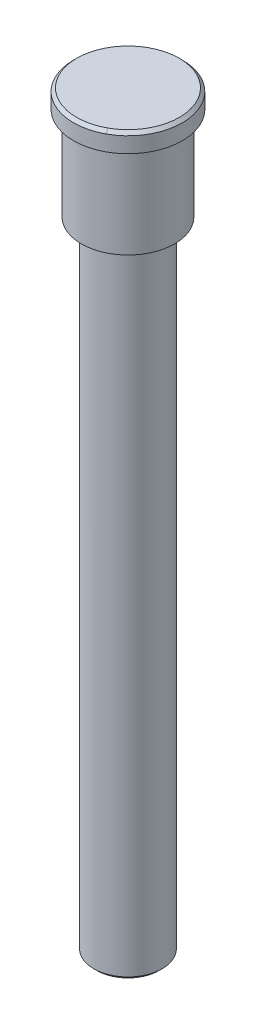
ISO-10303-21;
HEADER;
FILE_DESCRIPTION(('STEP AP214'),'2;1');
FILE_NAME('part.step','',(''),(''),'','','');
FILE_SCHEMA(('AUTOMOTIVE_DESIGN { 1 0 10303 214 1 1 1 1 }'));
ENDSEC;
DATA;
#1=APPLICATION_CONTEXT('core data for automotive mechanical design processes');
#2=APPLICATION_PROTOCOL_DEFINITION('international standard','automotive_design',2000,#1);
#3=PRODUCT_CONTEXT('',#1,'mechanical');
#4=PRODUCT('Part','Part','',(#3));
#5=PRODUCT_RELATED_PRODUCT_CATEGORY('part','',(#4));
#6=PRODUCT_DEFINITION_FORMATION('','',#4);
#7=PRODUCT_DEFINITION_CONTEXT('part definition',#1,'design');
#8=PRODUCT_DEFINITION('design','',#6,#7);
#9=PRODUCT_DEFINITION_SHAPE('','',#8);
#10=(LENGTH_UNIT() NAMED_UNIT(*) SI_UNIT(.MILLI.,.METRE.));
#11=(NAMED_UNIT(*) PLANE_ANGLE_UNIT() SI_UNIT($,.RADIAN.));
#12=(NAMED_UNIT(*) SI_UNIT($,.STERADIAN.) SOLID_ANGLE_UNIT());
#13=UNCERTAINTY_MEASURE_WITH_UNIT(LENGTH_MEASURE(1.E-05),#10,'distance_accuracy_value','');
#14=(GEOMETRIC_REPRESENTATION_CONTEXT(3) GLOBAL_UNCERTAINTY_ASSIGNED_CONTEXT((#13)) GLOBAL_UNIT_ASSIGNED_CONTEXT((#10,
#11,#12)) REPRESENTATION_CONTEXT('',''));
#15=CARTESIAN_POINT('',(0.,0.,0.));
#16=DIRECTION('',(0.,0.,1.));
#17=DIRECTION('',(1.,0.,0.));
#18=AXIS2_PLACEMENT_3D('',#15,#16,#17);
#19=CARTESIAN_POINT('',(0.,0.,0.));
#20=DIRECTION('',(0.,1.,0.));
#21=DIRECTION('',(0.,0.,1.));
#22=AXIS2_PLACEMENT_3D('',#19,#20,#21);
#23=PLANE('',#22);
#24=CARTESIAN_POINT('',(0.,-5.68017854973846E-11,0.));
#25=DIRECTION('',(0.,-1.,0.));
#26=DIRECTION('',(0.,0.,-1.));
#27=AXIS2_PLACEMENT_3D('',#24,#25,#26);
#28=CIRCLE('',#27,16.5000000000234);
#29=CARTESIAN_POINT('',(7.91052138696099,-2.84355872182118E-11,14.4801122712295));
#30=VERTEX_POINT('',#29);
#31=CARTESIAN_POINT('',(-7.91052085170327,-2.83939538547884E-11,-14.4801125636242));
#32=VERTEX_POINT('',#31);
#33=EDGE_CURVE('E20',#30,#32,#28,.T.);
#34=ORIENTED_EDGE('',*,*,#33,.F.);
#35=CARTESIAN_POINT('',(0.,0.,0.));
#36=DIRECTION('',(0.,-1.,0.));
#37=DIRECTION('',(0.,0.,-1.));
#38=AXIS2_PLACEMENT_3D('',#35,#36,#37);
#39=CIRCLE('',#38,16.5000000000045);
#40=EDGE_CURVE('E64',#32,#30,#39,.T.);
#41=ORIENTED_EDGE('',*,*,#40,.F.);
#42=EDGE_LOOP('',(#34,#41));
#43=FACE_BOUND('',#42,.T.);
#44=ADVANCED_FACE('F16',(#43),#23,.T.);
#45=CARTESIAN_POINT('',(0.,-0.999999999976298,0.));
#46=DIRECTION('',(0.,-1.,0.));
#47=DIRECTION('',(0.,0.,-1.));
#48=AXIS2_PLACEMENT_3D('',#45,#46,#47);
#49=CONICAL_SURFACE('',#48,17.4999999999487,0.785398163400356);
#50=DIRECTION('',(-0.339005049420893,0.707106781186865,-0.620544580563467));
#51=VECTOR('',#50,1.);
#52=CARTESIAN_POINT('',(239241.254284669,-499000.,437928.178495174));
#53=LINE('',#52,#51);
#54=CARTESIAN_POINT('',(8.38994692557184,-1.00000000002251,15.3576948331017));
#55=VERTEX_POINT('',#54);
#56=EDGE_CURVE('E62',#30,#55,#53,.F.);
#57=ORIENTED_EDGE('',*,*,#56,.F.);
#58=ORIENTED_EDGE('',*,*,#33,.T.);
#59=CARTESIAN_POINT('',(-8.38994692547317,-1.00000000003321,-15.3576948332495));
#60=CARTESIAN_POINT('',(-8.36997083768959,-0.958333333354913,-15.3211289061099));
#61=CARTESIAN_POINT('',(-8.34999475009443,-0.916666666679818,-15.2845629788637));
#62=CARTESIAN_POINT('',(-8.31004257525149,-0.833333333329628,-15.2114311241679));
#63=CARTESIAN_POINT('',(-8.29006648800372,-0.791666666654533,-15.1748651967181));
#64=CARTESIAN_POINT('',(-8.25011431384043,-0.708333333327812,-15.101733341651));
#65=CARTESIAN_POINT('',(-8.23013822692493,-0.666666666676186,-15.0651674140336));
#66=CARTESIAN_POINT('',(-8.19018605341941,-0.583333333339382,-14.9920355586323));
#67=CARTESIAN_POINT('',(-8.1702099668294,-0.541666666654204,-14.9554696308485));
#68=CARTESIAN_POINT('',(-8.13025779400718,-0.458333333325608,-14.8823377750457));
#69=CARTESIAN_POINT('',(-8.11028170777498,-0.41666666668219,-14.8457718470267));
#70=CARTESIAN_POINT('',(-8.07032953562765,-0.333333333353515,-14.7726399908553));
#71=CARTESIAN_POINT('',(-8.05035344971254,-0.291666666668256,-14.7360740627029));
#72=CARTESIAN_POINT('',(-8.01040127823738,-0.208333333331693,-14.6629422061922));
#73=CARTESIAN_POINT('',(-7.99042519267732,-0.166666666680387,-14.6263762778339));
#74=CARTESIAN_POINT('',(-7.95047302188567,-0.0833333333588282,-14.5532444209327));
#75=CARTESIAN_POINT('',(-7.93049693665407,-0.0416666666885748,-14.5166784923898));
#76=CARTESIAN_POINT('',(-7.91052085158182,0.,-14.4801125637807));
#77=B_SPLINE_CURVE_WITH_KNOTS('',3,(#59,#60,#61,#62,#63,#64,#65,#66,#67,#68,#69,#70,#71,#72,#73,
#74,#75,#76),.UNSPECIFIED.,.F.,.F.,(4,2,2,2,2,2,2,2,4),(0.,0.17677669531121,0.353553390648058,
0.53033008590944,0.70710678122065,0.883883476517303,1.06066017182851,1.23743686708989,
1.4142135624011),.UNSPECIFIED.);
#78=CARTESIAN_POINT('',(-8.38994692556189,-1.00000000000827,-15.3576948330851));
#79=VERTEX_POINT('',#78);
#80=EDGE_CURVE('E59',#79,#32,#77,.T.);
#81=ORIENTED_EDGE('',*,*,#80,.F.);
#82=CARTESIAN_POINT('',(0.,-1.00000000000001,0.));
#83=DIRECTION('',(0.,1.,0.));
#84=DIRECTION('',(0.,0.,1.));
#85=AXIS2_PLACEMENT_3D('',#82,#83,#84);
#86=CIRCLE('',#85,17.5);
#87=EDGE_CURVE('E66',#55,#79,#86,.F.);
#88=ORIENTED_EDGE('',*,*,#87,.F.);
#89=EDGE_LOOP('',(#57,#58,#81,#88));
#90=FACE_BOUND('',#89,.T.);
#91=ADVANCED_FACE('F57',(#90),#49,.T.);
#92=CARTESIAN_POINT('',(0.,-1.00000000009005,0.));
#93=DIRECTION('',(0.,-1.,0.));
#94=DIRECTION('',(0.,0.,-1.));
#95=AXIS2_PLACEMENT_3D('',#92,#93,#94);
#96=CONICAL_SURFACE('',#95,17.5000000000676,0.785398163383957);
#97=ORIENTED_EDGE('',*,*,#80,.T.);
#98=ORIENTED_EDGE('',*,*,#40,.T.);
#99=ORIENTED_EDGE('',*,*,#56,.T.);
#100=CARTESIAN_POINT('',(0.,-1.00000000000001,0.));
#101=DIRECTION('',(0.,1.,0.));
#102=DIRECTION('',(0.,0.,1.));
#103=AXIS2_PLACEMENT_3D('',#100,#101,#102);
#104=CIRCLE('',#103,17.5);
#105=EDGE_CURVE('E70',#79,#55,#104,.F.);
#106=ORIENTED_EDGE('',*,*,#105,.F.);
#107=EDGE_LOOP('',(#97,#98,#99,#106));
#108=FACE_BOUND('',#107,.T.);
#109=ADVANCED_FACE('F68',(#108),#96,.T.);
#110=CARTESIAN_POINT('',(0.,-120.5,0.));
#111=DIRECTION('',(0.,1.,0.));
#112=DIRECTION('',(0.,0.,1.));
#113=AXIS2_PLACEMENT_3D('',#110,#111,#112);
#114=CYLINDRICAL_SURFACE('',#113,17.5);
#115=CARTESIAN_POINT('',(0.,-6.00000000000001,0.));
#116=DIRECTION('',(0.,1.,0.));
#117=DIRECTION('',(0.,0.,1.));
#118=AXIS2_PLACEMENT_3D('',#115,#116,#117);
#119=CIRCLE('',#118,17.5);
#120=CARTESIAN_POINT('',(0.,-6.,17.5));
#121=VERTEX_POINT('',#120);
#122=EDGE_CURVE('E119',#121,#121,#119,.T.);
#123=ORIENTED_EDGE('',*,*,#122,.T.);
#124=EDGE_LOOP('',(#123));
#125=FACE_BOUND('',#124,.T.);
#126=ORIENTED_EDGE('',*,*,#105,.T.);
#127=ORIENTED_EDGE('',*,*,#87,.T.);
#128=EDGE_LOOP('',(#126,#127));
#129=FACE_BOUND('',#128,.T.);
#130=ADVANCED_FACE('F159',(#125,#129),#114,.T.);
#131=CARTESIAN_POINT('',(0.,-5.99999999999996,17.5));
#132=DIRECTION('',(0.,1.,0.));
#133=DIRECTION('',(0.,0.,1.));
#134=AXIS2_PLACEMENT_3D('',#131,#132,#133);
#135=PLANE('',#134);
#136=CARTESIAN_POINT('',(0.,-6.00000000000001,0.));
#137=DIRECTION('',(0.,1.,0.));
#138=DIRECTION('',(0.,0.,1.));
#139=AXIS2_PLACEMENT_3D('',#136,#137,#138);
#140=CIRCLE('',#139,15.);
#141=CARTESIAN_POINT('',(0.,-6.,15.));
#142=VERTEX_POINT('',#141);
#143=EDGE_CURVE('E122',#142,#142,#140,.F.);
#144=ORIENTED_EDGE('',*,*,#143,.F.);
#145=EDGE_LOOP('',(#144));
#146=FACE_BOUND('',#145,.T.);
#147=ORIENTED_EDGE('',*,*,#122,.F.);
#148=EDGE_LOOP('',(#147));
#149=FACE_BOUND('',#148,.T.);
#150=ADVANCED_FACE('F154',(#146,#149),#135,.F.);
#151=CARTESIAN_POINT('',(0.,-120.5,0.));
#152=DIRECTION('',(0.,1.,0.));
#153=DIRECTION('',(0.,0.,1.));
#154=AXIS2_PLACEMENT_3D('',#151,#152,#153);
#155=CYLINDRICAL_SURFACE('',#154,15.);
#156=CARTESIAN_POINT('',(0.,-36.,0.));
#157=DIRECTION('',(0.,1.,0.));
#158=DIRECTION('',(0.,0.,1.));
#159=AXIS2_PLACEMENT_3D('',#156,#157,#158);
#160=CIRCLE('',#159,15.);
#161=CARTESIAN_POINT('',(0.,-36.,15.));
#162=VERTEX_POINT('',#161);
#163=EDGE_CURVE('E132',#162,#162,#160,.T.);
#164=ORIENTED_EDGE('',*,*,#163,.T.);
#165=EDGE_LOOP('',(#164));
#166=FACE_BOUND('',#165,.T.);
#167=ORIENTED_EDGE('',*,*,#143,.T.);
#168=EDGE_LOOP('',(#167));
#169=FACE_BOUND('',#168,.T.);
#170=ADVANCED_FACE('F102',(#166,#169),#155,.T.);
#171=CARTESIAN_POINT('',(0.,-240.000000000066,0.));
#172=DIRECTION('',(0.,1.,0.));
#173=DIRECTION('',(-1.,0.,0.));
#174=AXIS2_PLACEMENT_3D('',#171,#172,#173);
#175=CONICAL_SURFACE('',#174,10.9999999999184,0.785398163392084);
#176=CARTESIAN_POINT('',(-4.79425457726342,-241.000000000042,-8.77582606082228));
#177=CARTESIAN_POINT('',(-4.81423067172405,-240.958333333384,-8.81239198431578));
#178=CARTESIAN_POINT('',(-4.83420676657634,-240.91666666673,-8.84895790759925));
#179=CARTESIAN_POINT('',(-4.87415895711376,-240.833333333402,-8.92208975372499));
#180=CARTESIAN_POINT('',(-4.8941350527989,-240.791666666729,-8.95865567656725));
#181=CARTESIAN_POINT('',(-4.9340872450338,-240.708333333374,-9.03178752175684));
#182=CARTESIAN_POINT('',(-4.95406334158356,-240.666666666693,-9.06835344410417));
#183=CARTESIAN_POINT('',(-4.99401553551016,-240.583333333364,-9.141485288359));
#184=CARTESIAN_POINT('',(-5.01399163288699,-240.541666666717,-9.17805121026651));
#185=CARTESIAN_POINT('',(-5.05394382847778,-240.458333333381,-9.25118305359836));
#186=CARTESIAN_POINT('',(-5.07391992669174,-240.416666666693,-9.2877489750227));
#187=CARTESIAN_POINT('',(-5.11387212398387,-240.333333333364,-9.36088081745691));
#188=CARTESIAN_POINT('',(-5.13384822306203,-240.291666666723,-9.39744673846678));
#189=CARTESIAN_POINT('',(-5.17380042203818,-240.208333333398,-9.47057857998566));
#190=CARTESIAN_POINT('',(-5.19377652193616,-240.166666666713,-9.50714450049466));
#191=CARTESIAN_POINT('',(-5.23372872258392,-240.083333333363,-9.58027634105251));
#192=CARTESIAN_POINT('',(-5.2537048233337,-240.041666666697,-9.61684226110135));
#193=CARTESIAN_POINT('',(-5.27368092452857,-240.000000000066,-9.65340818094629));
#194=B_SPLINE_CURVE_WITH_KNOTS('',3,(#176,#177,#178,#179,#180,#181,#182,#183,#184,#185,#186,
#187,#188,#189,#190,#191,#192,#193),.UNSPECIFIED.,.F.,.F.,(4,2,2,2,2,2,2,2,4),(0.,
0.176776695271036,0.353553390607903,0.530330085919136,0.707106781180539,0.883883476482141,
1.06066017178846,1.23743686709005,1.4142135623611),.UNSPECIFIED.);
#195=CARTESIAN_POINT('',(-4.79425457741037,-240.999999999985,-8.77582606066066));
#196=VERTEX_POINT('',#195);
#197=CARTESIAN_POINT('',(-5.27368092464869,-240.000000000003,-9.65340818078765));
#198=VERTEX_POINT('',#197);
#199=EDGE_CURVE('E35',#196,#198,#194,.T.);
#200=ORIENTED_EDGE('',*,*,#199,.T.);
#201=CARTESIAN_POINT('',(0.,-240.,0.));
#202=DIRECTION('',(0.,1.,0.));
#203=DIRECTION('',(0.,0.,1.));
#204=AXIS2_PLACEMENT_3D('',#201,#202,#203);
#205=CIRCLE('',#204,11.);
#206=CARTESIAN_POINT('',(5.27368092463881,-240.000000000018,9.65340818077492));
#207=VERTEX_POINT('',#206);
#208=EDGE_CURVE('E96',#207,#198,#205,.T.);
#209=ORIENTED_EDGE('',*,*,#208,.F.);
#210=DIRECTION('',(-0.339005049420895,-0.707106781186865,-0.620544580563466));
#211=VECTOR('',#210,1.);
#212=CARTESIAN_POINT('',(239353.679573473,499000.,438133.971605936));
#213=LINE('',#212,#211);
#214=CARTESIAN_POINT('',(4.79425538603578,-240.999999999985,8.77582561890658));
#215=VERTEX_POINT('',#214);
#216=EDGE_CURVE('E127',#207,#215,#213,.T.);
#217=ORIENTED_EDGE('',*,*,#216,.T.);
#218=CARTESIAN_POINT('',(0.,-240.999999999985,0.));
#219=DIRECTION('',(0.,1.,0.));
#220=DIRECTION('',(-1.,0.,0.));
#221=AXIS2_PLACEMENT_3D('',#218,#219,#220);
#222=CIRCLE('',#221,10.0000000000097);
#223=EDGE_CURVE('E130',#215,#196,#222,.T.);
#224=ORIENTED_EDGE('',*,*,#223,.T.);
#225=EDGE_LOOP('',(#200,#209,#217,#224));
#226=FACE_BOUND('',#225,.T.);
#227=ADVANCED_FACE('F104',(#226),#175,.T.);
#228=CARTESIAN_POINT('',(0.,-241.,11.));
#229=DIRECTION('',(0.,1.,0.));
#230=DIRECTION('',(0.,0.,1.));
#231=AXIS2_PLACEMENT_3D('',#228,#229,#230);
#232=PLANE('',#231);
#233=CARTESIAN_POINT('',(0.,-240.999999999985,0.));
#234=DIRECTION('',(0.,1.,0.));
#235=DIRECTION('',(0.,0.,1.));
#236=AXIS2_PLACEMENT_3D('',#233,#234,#235);
#237=CIRCLE('',#236,9.99999999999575);
#238=EDGE_CURVE('E135',#196,#215,#237,.T.);
#239=ORIENTED_EDGE('',*,*,#238,.F.);
#240=ORIENTED_EDGE('',*,*,#223,.F.);
#241=EDGE_LOOP('',(#239,#240));
#242=FACE_BOUND('',#241,.T.);
#243=ADVANCED_FACE('F148',(#242),#232,.F.);
#244=CARTESIAN_POINT('',(0.,-36.,15.));
#245=DIRECTION('',(0.,1.,0.));
#246=DIRECTION('',(0.,0.,1.));
#247=AXIS2_PLACEMENT_3D('',#244,#245,#246);
#248=PLANE('',#247);
#249=CARTESIAN_POINT('',(0.,-36.,0.));
#250=DIRECTION('',(0.,1.,0.));
#251=DIRECTION('',(0.,0.,1.));
#252=AXIS2_PLACEMENT_3D('',#249,#250,#251);
#253=CIRCLE('',#252,11.);
#254=CARTESIAN_POINT('',(0.,-36.,11.));
#255=VERTEX_POINT('',#254);
#256=EDGE_CURVE('E26',#255,#255,#253,.F.);
#257=ORIENTED_EDGE('',*,*,#256,.F.);
#258=EDGE_LOOP('',(#257));
#259=FACE_BOUND('',#258,.T.);
#260=ORIENTED_EDGE('',*,*,#163,.F.);
#261=EDGE_LOOP('',(#260));
#262=FACE_BOUND('',#261,.T.);
#263=ADVANCED_FACE('F144',(#259,#262),#248,.F.);
#264=CARTESIAN_POINT('',(0.,-240.000000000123,0.));
#265=DIRECTION('',(0.,1.,0.));
#266=DIRECTION('',(0.,0.,1.));
#267=AXIS2_PLACEMENT_3D('',#264,#265,#266);
#268=CONICAL_SURFACE('',#267,10.9999999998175,0.785398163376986);
#269=ORIENTED_EDGE('',*,*,#216,.F.);
#270=CARTESIAN_POINT('',(0.,-240.,0.));
#271=DIRECTION('',(0.,1.,0.));
#272=DIRECTION('',(0.,0.,1.));
#273=AXIS2_PLACEMENT_3D('',#270,#271,#272);
#274=CIRCLE('',#273,11.);
#275=EDGE_CURVE('E11',#198,#207,#274,.T.);
#276=ORIENTED_EDGE('',*,*,#275,.F.);
#277=ORIENTED_EDGE('',*,*,#199,.F.);
#278=ORIENTED_EDGE('',*,*,#238,.T.);
#279=EDGE_LOOP('',(#269,#276,#277,#278));
#280=FACE_BOUND('',#279,.T.);
#281=ADVANCED_FACE('F147',(#280),#268,.T.);
#282=CARTESIAN_POINT('',(0.,-120.5,0.));
#283=DIRECTION('',(0.,1.,0.));
#284=DIRECTION('',(0.,0.,1.));
#285=AXIS2_PLACEMENT_3D('',#282,#283,#284);
#286=CYLINDRICAL_SURFACE('',#285,11.);
#287=ORIENTED_EDGE('',*,*,#256,.T.);
#288=EDGE_LOOP('',(#287));
#289=FACE_BOUND('',#288,.T.);
#290=ORIENTED_EDGE('',*,*,#275,.T.);
#291=ORIENTED_EDGE('',*,*,#208,.T.);
#292=EDGE_LOOP('',(#290,#291));
#293=FACE_BOUND('',#292,.T.);
#294=ADVANCED_FACE('F18',(#289,#293),#286,.T.);
#295=CLOSED_SHELL('',(#44,#91,#109,#130,#150,#170,#227,#243,#263,#281,#294));
#296=MANIFOLD_SOLID_BREP('B1',#295);
#297=ADVANCED_BREP_SHAPE_REPRESENTATION('',(#18,#296),#14);
#298=SHAPE_DEFINITION_REPRESENTATION(#9,#297);
ENDSEC;
END-ISO-10303-21;
